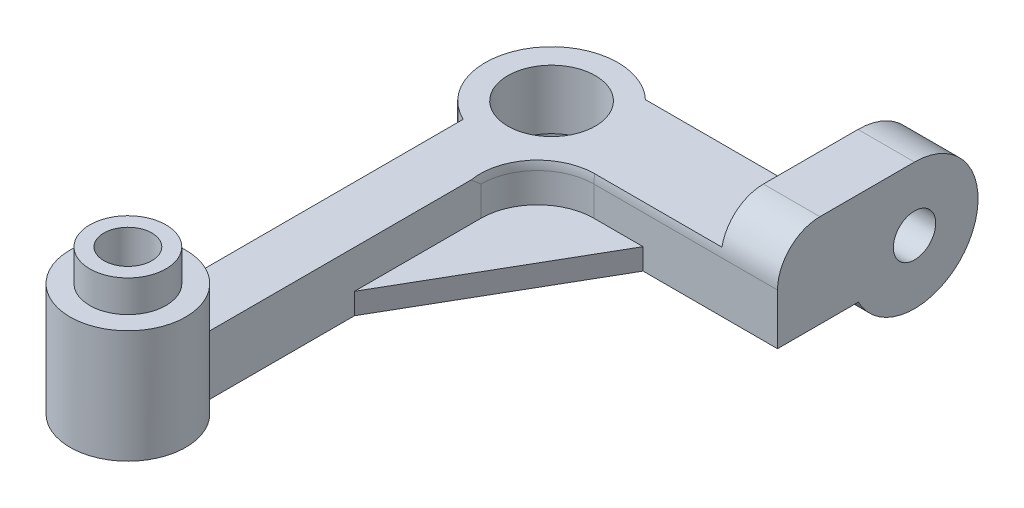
ISO-10303-21;
HEADER;
FILE_DESCRIPTION(('STEP AP214'),'2;1');
FILE_NAME('part.step','',(''),(''),'','','');
FILE_SCHEMA(('AUTOMOTIVE_DESIGN { 1 0 10303 214 1 1 1 1 }'));
ENDSEC;
DATA;
#1=APPLICATION_CONTEXT('core data for automotive mechanical design processes');
#2=APPLICATION_PROTOCOL_DEFINITION('international standard','automotive_design',2000,#1);
#3=PRODUCT_CONTEXT('',#1,'mechanical');
#4=PRODUCT('Part','Part','',(#3));
#5=PRODUCT_RELATED_PRODUCT_CATEGORY('part','',(#4));
#6=PRODUCT_DEFINITION_FORMATION('','',#4);
#7=PRODUCT_DEFINITION_CONTEXT('part definition',#1,'design');
#8=PRODUCT_DEFINITION('design','',#6,#7);
#9=PRODUCT_DEFINITION_SHAPE('','',#8);
#10=(LENGTH_UNIT() NAMED_UNIT(*) SI_UNIT(.MILLI.,.METRE.));
#11=(NAMED_UNIT(*) PLANE_ANGLE_UNIT() SI_UNIT($,.RADIAN.));
#12=(NAMED_UNIT(*) SI_UNIT($,.STERADIAN.) SOLID_ANGLE_UNIT());
#13=UNCERTAINTY_MEASURE_WITH_UNIT(LENGTH_MEASURE(1.E-05),#10,'distance_accuracy_value','');
#14=(GEOMETRIC_REPRESENTATION_CONTEXT(3) GLOBAL_UNCERTAINTY_ASSIGNED_CONTEXT((#13)) GLOBAL_UNIT_ASSIGNED_CONTEXT((#10,
#11,#12)) REPRESENTATION_CONTEXT('',''));
#15=CARTESIAN_POINT('',(0.,0.,0.));
#16=DIRECTION('',(0.,0.,1.));
#17=DIRECTION('',(1.,0.,0.));
#18=AXIS2_PLACEMENT_3D('',#15,#16,#17);
#19=CARTESIAN_POINT('',(0.,0.,30.));
#20=DIRECTION('',(0.,1.,0.));
#21=DIRECTION('',(0.,0.,1.));
#22=AXIS2_PLACEMENT_3D('',#19,#20,#21);
#23=PLANE('',#22);
#24=CARTESIAN_POINT('',(0.,0.,30.));
#25=DIRECTION('',(0.,1.,0.));
#26=DIRECTION('',(0.,0.,1.));
#27=AXIS2_PLACEMENT_3D('',#24,#25,#26);
#28=CIRCLE('',#27,1.7);
#29=CARTESIAN_POINT('',(0.,0.,31.7));
#30=VERTEX_POINT('',#29);
#31=EDGE_CURVE('E485',#30,#30,#28,.T.);
#32=ORIENTED_EDGE('',*,*,#31,.T.);
#33=EDGE_LOOP('',(#32));
#34=FACE_BOUND('',#33,.T.);
#35=DIRECTION('',(0.,0.,1.));
#36=VECTOR('',#35,1.);
#37=CARTESIAN_POINT('',(12.,0.,30.));
#38=LINE('',#37,#36);
#39=CARTESIAN_POINT('',(12.,0.,-3.4));
#40=VERTEX_POINT('',#39);
#41=CARTESIAN_POINT('',(12.,0.,-2.72005025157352));
#42=VERTEX_POINT('',#41);
#43=EDGE_CURVE('E199',#40,#42,#38,.T.);
#44=ORIENTED_EDGE('',*,*,#43,.T.);
#45=DIRECTION('',(-1.,0.,0.));
#46=VECTOR('',#45,1.);
#47=CARTESIAN_POINT('',(19.,0.,-2.72005025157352));
#48=LINE('',#47,#46);
#49=CARTESIAN_POINT('',(19.,0.,-2.72005025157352));
#50=VERTEX_POINT('',#49);
#51=EDGE_CURVE('E227',#50,#42,#48,.T.);
#52=ORIENTED_EDGE('',*,*,#51,.F.);
#53=DIRECTION('',(0.,0.,-1.));
#54=VECTOR('',#53,1.);
#55=CARTESIAN_POINT('',(19.,0.,3.00000000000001));
#56=LINE('',#55,#54);
#57=CARTESIAN_POINT('',(19.,0.,3.00000000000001));
#58=VERTEX_POINT('',#57);
#59=EDGE_CURVE('E225',#58,#50,#56,.T.);
#60=ORIENTED_EDGE('',*,*,#59,.F.);
#61=DIRECTION('',(1.,0.,0.));
#62=VECTOR('',#61,1.);
#63=CARTESIAN_POINT('',(15.,0.,3.));
#64=LINE('',#63,#62);
#65=CARTESIAN_POINT('',(9.47851149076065,0.,3.));
#66=VERTEX_POINT('',#65);
#67=EDGE_CURVE('E271',#66,#58,#64,.T.);
#68=ORIENTED_EDGE('',*,*,#67,.F.);
#69=DIRECTION('',(-0.500000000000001,0.,0.866025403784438));
#70=VECTOR('',#69,1.);
#71=CARTESIAN_POINT('',(2.,0.,15.9531618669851));
#72=LINE('',#71,#70);
#73=CARTESIAN_POINT('',(2.,0.,15.9531618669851));
#74=VERTEX_POINT('',#73);
#75=EDGE_CURVE('E242',#66,#74,#72,.T.);
#76=ORIENTED_EDGE('',*,*,#75,.T.);
#77=DIRECTION('',(0.,0.,-1.));
#78=VECTOR('',#77,1.);
#79=CARTESIAN_POINT('',(2.,0.,26.4208939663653));
#80=LINE('',#79,#78);
#81=CARTESIAN_POINT('',(2.,0.,26.4208939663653));
#82=VERTEX_POINT('',#81);
#83=EDGE_CURVE('E442',#82,#74,#80,.T.);
#84=ORIENTED_EDGE('',*,*,#83,.F.);
#85=CARTESIAN_POINT('',(0.,0.,30.));
#86=DIRECTION('',(0.,1.,0.));
#87=DIRECTION('',(0.,0.,1.));
#88=AXIS2_PLACEMENT_3D('',#85,#86,#87);
#89=CIRCLE('',#88,4.1);
#90=CARTESIAN_POINT('',(-2.,0.,26.4208939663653));
#91=VERTEX_POINT('',#90);
#92=EDGE_CURVE('E492',#91,#82,#89,.T.);
#93=ORIENTED_EDGE('',*,*,#92,.F.);
#94=DIRECTION('',(0.,0.,1.));
#95=VECTOR('',#94,1.);
#96=CARTESIAN_POINT('',(-2.,0.,26.4208939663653));
#97=LINE('',#96,#95);
#98=CARTESIAN_POINT('',(-1.99999999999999,0.,4.25323406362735));
#99=VERTEX_POINT('',#98);
#100=EDGE_CURVE('E259',#99,#91,#97,.T.);
#101=ORIENTED_EDGE('',*,*,#100,.F.);
#102=CARTESIAN_POINT('',(0.,0.,0.));
#103=DIRECTION('',(0.,-1.,0.));
#104=DIRECTION('',(0.,0.,-1.));
#105=AXIS2_PLACEMENT_3D('',#102,#103,#104);
#106=CIRCLE('',#105,4.7);
#107=CARTESIAN_POINT('',(3.24499614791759,0.,-3.4));
#108=VERTEX_POINT('',#107);
#109=EDGE_CURVE('E236',#108,#99,#106,.T.);
#110=ORIENTED_EDGE('',*,*,#109,.F.);
#111=DIRECTION('',(-1.,0.,0.));
#112=VECTOR('',#111,1.);
#113=CARTESIAN_POINT('',(3.24499614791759,0.,-3.4));
#114=LINE('',#113,#112);
#115=EDGE_CURVE('E262',#40,#108,#114,.T.);
#116=ORIENTED_EDGE('',*,*,#115,.F.);
#117=EDGE_LOOP('',(#44,#52,#60,#68,#76,#84,#93,#101,#110,#116));
#118=FACE_BOUND('',#117,.T.);
#119=ADVANCED_FACE('F35',(#34,#118),#23,.F.);
#120=CARTESIAN_POINT('',(3.24499614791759,4.2,-3.4));
#121=DIRECTION('',(0.,0.,1.));
#122=DIRECTION('',(1.,0.,0.));
#123=AXIS2_PLACEMENT_3D('',#120,#121,#122);
#124=PLANE('',#123);
#125=DIRECTION('',(0.,-1.,0.));
#126=VECTOR('',#125,1.);
#127=CARTESIAN_POINT('',(15.,4.2,-3.4));
#128=LINE('',#127,#126);
#129=CARTESIAN_POINT('',(15.,4.2,-3.4));
#130=VERTEX_POINT('',#129);
#131=CARTESIAN_POINT('',(15.,2.1,-3.4));
#132=VERTEX_POINT('',#131);
#133=EDGE_CURVE('E424',#130,#132,#128,.T.);
#134=ORIENTED_EDGE('',*,*,#133,.T.);
#135=DIRECTION('',(1.,0.,0.));
#136=VECTOR('',#135,1.);
#137=CARTESIAN_POINT('',(12.,2.1,-3.4));
#138=LINE('',#137,#136);
#139=CARTESIAN_POINT('',(12.,2.1,-3.4));
#140=VERTEX_POINT('',#139);
#141=EDGE_CURVE('E458',#140,#132,#138,.T.);
#142=ORIENTED_EDGE('',*,*,#141,.F.);
#143=DIRECTION('',(0.,-1.,0.));
#144=VECTOR('',#143,1.);
#145=CARTESIAN_POINT('',(12.,4.2,-3.4));
#146=LINE('',#145,#144);
#147=EDGE_CURVE('E189',#140,#40,#146,.T.);
#148=ORIENTED_EDGE('',*,*,#147,.T.);
#149=ORIENTED_EDGE('',*,*,#115,.T.);
#150=DIRECTION('',(0.,-1.,0.));
#151=VECTOR('',#150,1.);
#152=CARTESIAN_POINT('',(3.24499614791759,4.2,-3.4));
#153=LINE('',#152,#151);
#154=CARTESIAN_POINT('',(3.24499614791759,4.2,-3.4));
#155=VERTEX_POINT('',#154);
#156=EDGE_CURVE('E255',#155,#108,#153,.T.);
#157=ORIENTED_EDGE('',*,*,#156,.F.);
#158=DIRECTION('',(-1.,0.,0.));
#159=VECTOR('',#158,1.);
#160=CARTESIAN_POINT('',(3.24499614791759,4.2,-3.4));
#161=LINE('',#160,#159);
#162=EDGE_CURVE('E385',#130,#155,#161,.T.);
#163=ORIENTED_EDGE('',*,*,#162,.F.);
#164=EDGE_LOOP('',(#134,#142,#148,#149,#157,#163));
#165=FACE_BOUND('',#164,.T.);
#166=ADVANCED_FACE('F343',(#165),#124,.F.);
#167=CARTESIAN_POINT('',(15.,2.1,-6.69999999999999));
#168=DIRECTION('',(1.,0.,0.));
#169=DIRECTION('',(0.,0.,-1.));
#170=AXIS2_PLACEMENT_3D('',#167,#168,#169);
#171=PLANE('',#170);
#172=DIRECTION('',(0.,0.,-1.));
#173=VECTOR('',#172,1.);
#174=CARTESIAN_POINT('',(15.,4.2,-3.4));
#175=LINE('',#174,#173);
#176=CARTESIAN_POINT('',(15.,4.2,2.93938769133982));
#177=VERTEX_POINT('',#176);
#178=EDGE_CURVE('E382',#177,#130,#175,.T.);
#179=ORIENTED_EDGE('',*,*,#178,.F.);
#180=CARTESIAN_POINT('',(15.,3.6,0.));
#181=DIRECTION('',(1.,0.,0.));
#182=DIRECTION('',(0.,0.,-1.));
#183=AXIS2_PLACEMENT_3D('',#180,#181,#182);
#184=CIRCLE('',#183,3.);
#185=CARTESIAN_POINT('',(15.,6.6,0.));
#186=VERTEX_POINT('',#185);
#187=EDGE_CURVE('E375',#177,#186,#184,.F.);
#188=ORIENTED_EDGE('',*,*,#187,.T.);
#189=DIRECTION('',(0.,0.,1.));
#190=VECTOR('',#189,1.);
#191=CARTESIAN_POINT('',(15.,6.6,-6.7));
#192=LINE('',#191,#190);
#193=CARTESIAN_POINT('',(15.,6.6,-6.7));
#194=VERTEX_POINT('',#193);
#195=EDGE_CURVE('E221',#194,#186,#192,.T.);
#196=ORIENTED_EDGE('',*,*,#195,.F.);
#197=CARTESIAN_POINT('',(15.,2.1,-6.69999999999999));
#198=DIRECTION('',(1.,0.,0.));
#199=DIRECTION('',(0.,0.,-1.));
#200=AXIS2_PLACEMENT_3D('',#197,#198,#199);
#201=CIRCLE('',#200,4.5);
#202=CARTESIAN_POINT('',(15.,4.31149343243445,-10.6190938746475));
#203=VERTEX_POINT('',#202);
#204=EDGE_CURVE('E216',#203,#194,#201,.T.);
#205=ORIENTED_EDGE('',*,*,#204,.F.);
#206=DIRECTION('',(0.,0.,-1.));
#207=VECTOR('',#206,1.);
#208=CARTESIAN_POINT('',(15.,4.31149343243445,-9.99999999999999));
#209=LINE('',#208,#207);
#210=CARTESIAN_POINT('',(15.,4.31149343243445,-9.99999999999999));
#211=VERTEX_POINT('',#210);
#212=EDGE_CURVE('E193',#211,#203,#209,.T.);
#213=ORIENTED_EDGE('',*,*,#212,.F.);
#214=DIRECTION('',(0.,1.,0.));
#215=VECTOR('',#214,1.);
#216=CARTESIAN_POINT('',(15.,2.1,-9.99999999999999));
#217=LINE('',#216,#215);
#218=CARTESIAN_POINT('',(15.,2.1,-9.99999999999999));
#219=VERTEX_POINT('',#218);
#220=EDGE_CURVE('E451',#219,#211,#217,.T.);
#221=ORIENTED_EDGE('',*,*,#220,.F.);
#222=CARTESIAN_POINT('',(15.,2.1,-6.69999999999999));
#223=DIRECTION('',(-1.,0.,0.));
#224=DIRECTION('',(0.,0.,1.));
#225=AXIS2_PLACEMENT_3D('',#222,#223,#224);
#226=CIRCLE('',#225,3.3);
#227=EDGE_CURVE('E198',#132,#219,#226,.T.);
#228=ORIENTED_EDGE('',*,*,#227,.F.);
#229=ORIENTED_EDGE('',*,*,#133,.F.);
#230=EDGE_LOOP('',(#179,#188,#196,#205,#213,#221,#228,#229));
#231=FACE_BOUND('',#230,.T.);
#232=ADVANCED_FACE('F356',(#231),#171,.F.);
#233=CARTESIAN_POINT('',(19.,2.1,-6.69999999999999));
#234=DIRECTION('',(-1.,0.,0.));
#235=DIRECTION('',(0.,0.,1.));
#236=AXIS2_PLACEMENT_3D('',#233,#234,#235);
#237=CYLINDRICAL_SURFACE('',#236,1.5);
#238=CARTESIAN_POINT('',(19.,2.1,-6.69999999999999));
#239=DIRECTION('',(1.,0.,0.));
#240=DIRECTION('',(0.,0.,-1.));
#241=AXIS2_PLACEMENT_3D('',#238,#239,#240);
#242=CIRCLE('',#241,1.5);
#243=CARTESIAN_POINT('',(19.,2.1,-8.2));
#244=VERTEX_POINT('',#243);
#245=EDGE_CURVE('E213',#244,#244,#242,.T.);
#246=ORIENTED_EDGE('',*,*,#245,.T.);
#247=EDGE_LOOP('',(#246));
#248=FACE_BOUND('',#247,.T.);
#249=CARTESIAN_POINT('',(16.,2.1,-6.69999999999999));
#250=DIRECTION('',(-1.,0.,0.));
#251=DIRECTION('',(0.,0.,1.));
#252=AXIS2_PLACEMENT_3D('',#249,#250,#251);
#253=CIRCLE('',#252,1.5);
#254=CARTESIAN_POINT('',(16.,2.1,-5.2));
#255=VERTEX_POINT('',#254);
#256=EDGE_CURVE('E211',#255,#255,#253,.T.);
#257=ORIENTED_EDGE('',*,*,#256,.T.);
#258=EDGE_LOOP('',(#257));
#259=FACE_BOUND('',#258,.T.);
#260=ADVANCED_FACE('F396',(#248,#259),#237,.F.);
#261=CARTESIAN_POINT('',(0.,0.,0.));
#262=DIRECTION('',(0.,1.,0.));
#263=DIRECTION('',(0.,0.,1.));
#264=AXIS2_PLACEMENT_3D('',#261,#262,#263);
#265=CIRCLE('',#264,3.1);
#266=CARTESIAN_POINT('',(0.,0.,3.1));
#267=VERTEX_POINT('',#266);
#268=EDGE_CURVE('E488',#267,#267,#265,.T.);
#269=ORIENTED_EDGE('',*,*,#268,.T.);
#270=EDGE_LOOP('',(#269));
#271=FACE_BOUND('',#270,.T.);
#272=CARTESIAN_POINT('',(0.,0.,0.));
#273=DIRECTION('',(0.,-1.,0.));
#274=DIRECTION('',(0.,0.,-1.));
#275=AXIS2_PLACEMENT_3D('',#272,#273,#274);
#276=CIRCLE('',#275,3.2);
#277=CARTESIAN_POINT('',(0.,0.,-3.2));
#278=VERTEX_POINT('',#277);
#279=EDGE_CURVE('E232',#278,#278,#276,.T.);
#280=ORIENTED_EDGE('',*,*,#279,.T.);
#281=EDGE_LOOP('',(#280));
#282=FACE_BOUND('',#281,.T.);
#283=ADVANCED_FACE('F345',(#271,#282),#23,.F.);
#284=CARTESIAN_POINT('',(6.00000000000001,4.2,7.00000000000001));
#285=DIRECTION('',(0.,-1.,0.));
#286=DIRECTION('',(0.,0.,-1.));
#287=AXIS2_PLACEMENT_3D('',#284,#285,#286);
#288=CYLINDRICAL_SURFACE('',#287,4.);
#289=DIRECTION('',(0.,-1.,0.));
#290=VECTOR('',#289,1.);
#291=CARTESIAN_POINT('',(6.00000000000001,4.2,3.00000000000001));
#292=LINE('',#291,#290);
#293=CARTESIAN_POINT('',(6.00000000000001,3.6,3.00000000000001));
#294=VERTEX_POINT('',#293);
#295=CARTESIAN_POINT('',(6.00000000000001,1.5,3.00000000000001));
#296=VERTEX_POINT('',#295);
#297=EDGE_CURVE('E465',#294,#296,#292,.T.);
#298=ORIENTED_EDGE('',*,*,#297,.F.);
#299=CARTESIAN_POINT('',(6.00000000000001,3.6,7.00000000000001));
#300=DIRECTION('',(0.,-1.,0.));
#301=DIRECTION('',(0.,0.,-1.));
#302=AXIS2_PLACEMENT_3D('',#299,#300,#301);
#303=CIRCLE('',#302,4.);
#304=CARTESIAN_POINT('',(2.00000000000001,3.6,7.00000000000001));
#305=VERTEX_POINT('',#304);
#306=EDGE_CURVE('E59',#294,#305,#303,.F.);
#307=ORIENTED_EDGE('',*,*,#306,.T.);
#308=DIRECTION('',(0.,-1.,0.));
#309=VECTOR('',#308,1.);
#310=CARTESIAN_POINT('',(2.00000000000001,4.2,7.00000000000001));
#311=LINE('',#310,#309);
#312=CARTESIAN_POINT('',(2.00000000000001,1.5,7.00000000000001));
#313=VERTEX_POINT('',#312);
#314=EDGE_CURVE('E467',#305,#313,#311,.T.);
#315=ORIENTED_EDGE('',*,*,#314,.T.);
#316=CARTESIAN_POINT('',(6.00000000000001,1.5,7.00000000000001));
#317=DIRECTION('',(0.,-1.,0.));
#318=DIRECTION('',(0.,0.,-1.));
#319=AXIS2_PLACEMENT_3D('',#316,#317,#318);
#320=CIRCLE('',#319,4.);
#321=EDGE_CURVE('E510',#296,#313,#320,.F.);
#322=ORIENTED_EDGE('',*,*,#321,.F.);
#323=EDGE_LOOP('',(#298,#307,#315,#322));
#324=FACE_BOUND('',#323,.T.);
#325=ADVANCED_FACE('F327',(#324),#288,.F.);
#326=CARTESIAN_POINT('',(0.,8.,30.));
#327=DIRECTION('',(0.,1.,0.));
#328=DIRECTION('',(0.,0.,1.));
#329=AXIS2_PLACEMENT_3D('',#326,#327,#328);
#330=PLANE('',#329);
#331=CARTESIAN_POINT('',(0.,8.,30.));
#332=DIRECTION('',(0.,1.,0.));
#333=DIRECTION('',(0.,0.,1.));
#334=AXIS2_PLACEMENT_3D('',#331,#332,#333);
#335=CIRCLE('',#334,4.1);
#336=CARTESIAN_POINT('',(0.,8.,34.1));
#337=VERTEX_POINT('',#336);
#338=EDGE_CURVE('E482',#337,#337,#335,.T.);
#339=ORIENTED_EDGE('',*,*,#338,.T.);
#340=EDGE_LOOP('',(#339));
#341=FACE_BOUND('',#340,.T.);
#342=CARTESIAN_POINT('',(0.,8.,30.));
#343=DIRECTION('',(0.,1.,0.));
#344=DIRECTION('',(0.,0.,1.));
#345=AXIS2_PLACEMENT_3D('',#342,#343,#344);
#346=CIRCLE('',#345,2.7);
#347=CARTESIAN_POINT('',(0.,8.,32.7));
#348=VERTEX_POINT('',#347);
#349=EDGE_CURVE('E520',#348,#348,#346,.T.);
#350=ORIENTED_EDGE('',*,*,#349,.F.);
#351=EDGE_LOOP('',(#350));
#352=FACE_BOUND('',#351,.T.);
#353=ADVANCED_FACE('F323',(#341,#352),#330,.T.);
#354=CARTESIAN_POINT('',(0.,4.2,30.));
#355=DIRECTION('',(0.,1.,0.));
#356=DIRECTION('',(0.,0.,1.));
#357=AXIS2_PLACEMENT_3D('',#354,#355,#356);
#358=PLANE('',#357);
#359=CARTESIAN_POINT('',(6.00000000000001,4.2,7.00000000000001));
#360=DIRECTION('',(0.,-1.,0.));
#361=DIRECTION('',(0.,0.,-1.));
#362=AXIS2_PLACEMENT_3D('',#359,#360,#361);
#363=CIRCLE('',#362,4.06061230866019);
#364=CARTESIAN_POINT('',(2.,4.2,7.69897948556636));
#365=VERTEX_POINT('',#364);
#366=CARTESIAN_POINT('',(6.00000000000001,4.2,2.93938769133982));
#367=VERTEX_POINT('',#366);
#368=EDGE_CURVE('E379',#365,#367,#363,.T.);
#369=ORIENTED_EDGE('',*,*,#368,.T.);
#370=DIRECTION('',(-1.,0.,0.));
#371=VECTOR('',#370,1.);
#372=CARTESIAN_POINT('',(6.00000000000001,4.2,2.93938769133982));
#373=LINE('',#372,#371);
#374=EDGE_CURVE('E377',#367,#177,#373,.F.);
#375=ORIENTED_EDGE('',*,*,#374,.T.);
#376=ORIENTED_EDGE('',*,*,#178,.T.);
#377=ORIENTED_EDGE('',*,*,#162,.T.);
#378=CARTESIAN_POINT('',(0.,4.2,0.));
#379=DIRECTION('',(0.,1.,0.));
#380=DIRECTION('',(0.,0.,1.));
#381=AXIS2_PLACEMENT_3D('',#378,#379,#380);
#382=CIRCLE('',#381,4.7);
#383=CARTESIAN_POINT('',(-1.99999999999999,4.2,4.25323406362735));
#384=VERTEX_POINT('',#383);
#385=EDGE_CURVE('E496',#155,#384,#382,.T.);
#386=ORIENTED_EDGE('',*,*,#385,.T.);
#387=DIRECTION('',(0.,0.,1.));
#388=VECTOR('',#387,1.);
#389=CARTESIAN_POINT('',(-2.,4.2,26.4208939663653));
#390=LINE('',#389,#388);
#391=CARTESIAN_POINT('',(-2.,4.2,26.4208939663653));
#392=VERTEX_POINT('',#391);
#393=EDGE_CURVE('E498',#384,#392,#390,.T.);
#394=ORIENTED_EDGE('',*,*,#393,.T.);
#395=CARTESIAN_POINT('',(0.,4.2,30.));
#396=DIRECTION('',(0.,1.,0.));
#397=DIRECTION('',(0.,0.,1.));
#398=AXIS2_PLACEMENT_3D('',#395,#396,#397);
#399=CIRCLE('',#398,4.1);
#400=CARTESIAN_POINT('',(2.,4.2,26.4208939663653));
#401=VERTEX_POINT('',#400);
#402=EDGE_CURVE('E478',#401,#392,#399,.T.);
#403=ORIENTED_EDGE('',*,*,#402,.F.);
#404=DIRECTION('',(0.,0.,-1.));
#405=VECTOR('',#404,1.);
#406=CARTESIAN_POINT('',(2.,4.2,26.4208939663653));
#407=LINE('',#406,#405);
#408=EDGE_CURVE('E261',#401,#365,#407,.T.);
#409=ORIENTED_EDGE('',*,*,#408,.T.);
#410=EDGE_LOOP('',(#369,#375,#376,#377,#386,#394,#403,#409));
#411=FACE_BOUND('',#410,.T.);
#412=CARTESIAN_POINT('',(0.,4.2,0.));
#413=DIRECTION('',(0.,1.,0.));
#414=DIRECTION('',(0.,0.,1.));
#415=AXIS2_PLACEMENT_3D('',#412,#413,#414);
#416=CIRCLE('',#415,3.1);
#417=CARTESIAN_POINT('',(0.,4.2,3.1));
#418=VERTEX_POINT('',#417);
#419=EDGE_CURVE('E489',#418,#418,#416,.T.);
#420=ORIENTED_EDGE('',*,*,#419,.F.);
#421=EDGE_LOOP('',(#420));
#422=FACE_BOUND('',#421,.T.);
#423=ADVANCED_FACE('F326',(#411,#422),#358,.T.);
#424=CARTESIAN_POINT('',(0.,4.2,30.));
#425=DIRECTION('',(0.,-1.,0.));
#426=DIRECTION('',(0.,0.,-1.));
#427=AXIS2_PLACEMENT_3D('',#424,#425,#426);
#428=CYLINDRICAL_SURFACE('',#427,4.1);
#429=ORIENTED_EDGE('',*,*,#92,.T.);
#430=DIRECTION('',(0.,-1.,0.));
#431=VECTOR('',#430,1.);
#432=CARTESIAN_POINT('',(2.,4.2,26.4208939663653));
#433=LINE('',#432,#431);
#434=EDGE_CURVE('E473',#401,#82,#433,.T.);
#435=ORIENTED_EDGE('',*,*,#434,.F.);
#436=ORIENTED_EDGE('',*,*,#402,.T.);
#437=DIRECTION('',(0.,-1.,0.));
#438=VECTOR('',#437,1.);
#439=CARTESIAN_POINT('',(-2.,4.2,26.4208939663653));
#440=LINE('',#439,#438);
#441=EDGE_CURVE('E256',#392,#91,#440,.T.);
#442=ORIENTED_EDGE('',*,*,#441,.T.);
#443=EDGE_LOOP('',(#429,#435,#436,#442));
#444=FACE_BOUND('',#443,.T.);
#445=ORIENTED_EDGE('',*,*,#338,.F.);
#446=EDGE_LOOP('',(#445));
#447=FACE_BOUND('',#446,.T.);
#448=ADVANCED_FACE('F339',(#444,#447),#428,.T.);
#449=CARTESIAN_POINT('',(2.,4.2,26.4208939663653));
#450=DIRECTION('',(-1.,0.,0.));
#451=DIRECTION('',(0.,0.,1.));
#452=AXIS2_PLACEMENT_3D('',#449,#450,#451);
#453=PLANE('',#452);
#454=ORIENTED_EDGE('',*,*,#314,.F.);
#455=CARTESIAN_POINT('',(2.,4.2,7.69897948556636));
#456=CARTESIAN_POINT('',(2.00000000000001,4.10237899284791,7.58321865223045));
#457=CARTESIAN_POINT('',(2.00000000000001,4.00401303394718,7.46809592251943));
#458=CARTESIAN_POINT('',(2.00000000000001,3.80652812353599,7.23849961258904));
#459=CARTESIAN_POINT('',(2.00000000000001,3.70740918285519,7.12402602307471));
#460=CARTESIAN_POINT('',(2.00000000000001,3.60552052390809,7.00637455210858));
#461=CARTESIAN_POINT('',(2.00000000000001,3.60276026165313,7.00318727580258));
#462=CARTESIAN_POINT('',(2.00000000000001,3.6,7.));
#463=B_SPLINE_CURVE_WITH_KNOTS('',3,(#455,#456,#457,#458,#459,#460,#461,#462),.UNSPECIFIED.,.F.,
.F.,(4,2,2,4),(0.,0.454271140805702,0.908535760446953,0.921184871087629),.UNSPECIFIED.);
#464=EDGE_CURVE('E368',#305,#365,#463,.F.);
#465=ORIENTED_EDGE('',*,*,#464,.T.);
#466=ORIENTED_EDGE('',*,*,#408,.F.);
#467=ORIENTED_EDGE('',*,*,#434,.T.);
#468=ORIENTED_EDGE('',*,*,#83,.T.);
#469=DIRECTION('',(0.,-1.,0.));
#470=VECTOR('',#469,1.);
#471=CARTESIAN_POINT('',(2.,1.5,15.9531618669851));
#472=LINE('',#471,#470);
#473=CARTESIAN_POINT('',(2.,1.5,15.9531618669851));
#474=VERTEX_POINT('',#473);
#475=EDGE_CURVE('E503',#474,#74,#472,.T.);
#476=ORIENTED_EDGE('',*,*,#475,.F.);
#477=DIRECTION('',(0.,0.,-1.));
#478=VECTOR('',#477,1.);
#479=CARTESIAN_POINT('',(2.,1.5,3.));
#480=LINE('',#479,#478);
#481=EDGE_CURVE('E245',#474,#313,#480,.T.);
#482=ORIENTED_EDGE('',*,*,#481,.T.);
#483=EDGE_LOOP('',(#454,#465,#466,#467,#468,#476,#482));
#484=FACE_BOUND('',#483,.T.);
#485=ADVANCED_FACE('F360',(#484),#453,.F.);
#486=CARTESIAN_POINT('',(15.,4.2,3.));
#487=DIRECTION('',(0.,0.,-1.));
#488=DIRECTION('',(-1.,0.,0.));
#489=AXIS2_PLACEMENT_3D('',#486,#487,#488);
#490=PLANE('',#489);
#491=DIRECTION('',(0.,-1.,0.));
#492=VECTOR('',#491,1.);
#493=CARTESIAN_POINT('',(19.,0.,3.00000000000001));
#494=LINE('',#493,#492);
#495=CARTESIAN_POINT('',(19.,3.6,3.00000000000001));
#496=VERTEX_POINT('',#495);
#497=EDGE_CURVE('E223',#496,#58,#494,.T.);
#498=ORIENTED_EDGE('',*,*,#497,.F.);
#499=DIRECTION('',(-1.,0.,0.));
#500=VECTOR('',#499,1.);
#501=CARTESIAN_POINT('',(15.,3.6,3.));
#502=LINE('',#501,#500);
#503=EDGE_CURVE('E381',#496,#294,#502,.T.);
#504=ORIENTED_EDGE('',*,*,#503,.T.);
#505=ORIENTED_EDGE('',*,*,#297,.T.);
#506=DIRECTION('',(-1.,0.,0.));
#507=VECTOR('',#506,1.);
#508=CARTESIAN_POINT('',(15.,1.5,3.));
#509=LINE('',#508,#507);
#510=CARTESIAN_POINT('',(9.47851149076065,1.5,3.));
#511=VERTEX_POINT('',#510);
#512=EDGE_CURVE('E250',#511,#296,#509,.T.);
#513=ORIENTED_EDGE('',*,*,#512,.F.);
#514=DIRECTION('',(0.,-1.,0.));
#515=VECTOR('',#514,1.);
#516=CARTESIAN_POINT('',(9.47851149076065,1.5,3.));
#517=LINE('',#516,#515);
#518=EDGE_CURVE('E438',#511,#66,#517,.T.);
#519=ORIENTED_EDGE('',*,*,#518,.T.);
#520=ORIENTED_EDGE('',*,*,#67,.T.);
#521=EDGE_LOOP('',(#498,#504,#505,#513,#519,#520));
#522=FACE_BOUND('',#521,.T.);
#523=ADVANCED_FACE('F352',(#522),#490,.F.);
#524=CARTESIAN_POINT('',(0.,4.2,0.));
#525=DIRECTION('',(0.,-1.,0.));
#526=DIRECTION('',(0.,0.,-1.));
#527=AXIS2_PLACEMENT_3D('',#524,#525,#526);
#528=CYLINDRICAL_SURFACE('',#527,4.7);
#529=ORIENTED_EDGE('',*,*,#156,.T.);
#530=ORIENTED_EDGE('',*,*,#109,.T.);
#531=DIRECTION('',(0.,-1.,0.));
#532=VECTOR('',#531,1.);
#533=CARTESIAN_POINT('',(-1.99999999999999,4.2,4.25323406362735));
#534=LINE('',#533,#532);
#535=EDGE_CURVE('E252',#384,#99,#534,.T.);
#536=ORIENTED_EDGE('',*,*,#535,.F.);
#537=ORIENTED_EDGE('',*,*,#385,.F.);
#538=EDGE_LOOP('',(#529,#530,#536,#537));
#539=FACE_BOUND('',#538,.T.);
#540=CARTESIAN_POINT('',(0.,-3.,0.));
#541=DIRECTION('',(0.,-1.,0.));
#542=DIRECTION('',(0.,0.,-1.));
#543=AXIS2_PLACEMENT_3D('',#540,#541,#542);
#544=CIRCLE('',#543,4.7);
#545=CARTESIAN_POINT('',(0.,-3.,-4.7));
#546=VERTEX_POINT('',#545);
#547=EDGE_CURVE('E239',#546,#546,#544,.T.);
#548=ORIENTED_EDGE('',*,*,#547,.F.);
#549=EDGE_LOOP('',(#548));
#550=FACE_BOUND('',#549,.T.);
#551=ADVANCED_FACE('F348',(#539,#550),#528,.T.);
#552=CARTESIAN_POINT('',(-2.,4.2,26.4208939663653));
#553=DIRECTION('',(1.,0.,0.));
#554=DIRECTION('',(0.,0.,-1.));
#555=AXIS2_PLACEMENT_3D('',#552,#553,#554);
#556=PLANE('',#555);
#557=ORIENTED_EDGE('',*,*,#100,.T.);
#558=ORIENTED_EDGE('',*,*,#441,.F.);
#559=ORIENTED_EDGE('',*,*,#393,.F.);
#560=ORIENTED_EDGE('',*,*,#535,.T.);
#561=EDGE_LOOP('',(#557,#558,#559,#560));
#562=FACE_BOUND('',#561,.T.);
#563=ADVANCED_FACE('F335',(#562),#556,.F.);
#564=CARTESIAN_POINT('',(0.,4.2,0.));
#565=DIRECTION('',(0.,-1.,0.));
#566=DIRECTION('',(0.,0.,-1.));
#567=AXIS2_PLACEMENT_3D('',#564,#565,#566);
#568=CYLINDRICAL_SURFACE('',#567,3.1);
#569=ORIENTED_EDGE('',*,*,#419,.T.);
#570=EDGE_LOOP('',(#569));
#571=FACE_BOUND('',#570,.T.);
#572=ORIENTED_EDGE('',*,*,#268,.F.);
#573=EDGE_LOOP('',(#572));
#574=FACE_BOUND('',#573,.T.);
#575=ADVANCED_FACE('F331',(#571,#574),#568,.F.);
#576=CARTESIAN_POINT('',(0.,4.2,30.));
#577=DIRECTION('',(0.,-1.,0.));
#578=DIRECTION('',(0.,0.,-1.));
#579=AXIS2_PLACEMENT_3D('',#576,#577,#578);
#580=CYLINDRICAL_SURFACE('',#579,1.7);
#581=ORIENTED_EDGE('',*,*,#31,.F.);
#582=EDGE_LOOP('',(#581));
#583=FACE_BOUND('',#582,.T.);
#584=CARTESIAN_POINT('',(0.,10.25,30.));
#585=DIRECTION('',(0.,1.,0.));
#586=DIRECTION('',(0.,0.,1.));
#587=AXIS2_PLACEMENT_3D('',#584,#585,#586);
#588=CIRCLE('',#587,1.7);
#589=CARTESIAN_POINT('',(0.,10.25,31.7));
#590=VERTEX_POINT('',#589);
#591=EDGE_CURVE('E517',#590,#590,#588,.T.);
#592=ORIENTED_EDGE('',*,*,#591,.T.);
#593=EDGE_LOOP('',(#592));
#594=FACE_BOUND('',#593,.T.);
#595=ADVANCED_FACE('F318',(#583,#594),#580,.F.);
#596=CARTESIAN_POINT('',(0.,10.25,30.));
#597=DIRECTION('',(0.,1.,0.));
#598=DIRECTION('',(0.,0.,1.));
#599=AXIS2_PLACEMENT_3D('',#596,#597,#598);
#600=PLANE('',#599);
#601=CARTESIAN_POINT('',(0.,10.25,30.));
#602=DIRECTION('',(0.,1.,0.));
#603=DIRECTION('',(0.,0.,1.));
#604=AXIS2_PLACEMENT_3D('',#601,#602,#603);
#605=CIRCLE('',#604,2.7);
#606=CARTESIAN_POINT('',(0.,10.25,32.7));
#607=VERTEX_POINT('',#606);
#608=EDGE_CURVE('E483',#607,#607,#605,.T.);
#609=ORIENTED_EDGE('',*,*,#608,.T.);
#610=EDGE_LOOP('',(#609));
#611=FACE_BOUND('',#610,.T.);
#612=ORIENTED_EDGE('',*,*,#591,.F.);
#613=EDGE_LOOP('',(#612));
#614=FACE_BOUND('',#613,.T.);
#615=ADVANCED_FACE('F315',(#611,#614),#600,.T.);
#616=CARTESIAN_POINT('',(0.,10.25,30.));
#617=DIRECTION('',(0.,-1.,0.));
#618=DIRECTION('',(0.,0.,-1.));
#619=AXIS2_PLACEMENT_3D('',#616,#617,#618);
#620=CYLINDRICAL_SURFACE('',#619,2.7);
#621=ORIENTED_EDGE('',*,*,#608,.F.);
#622=EDGE_LOOP('',(#621));
#623=FACE_BOUND('',#622,.T.);
#624=ORIENTED_EDGE('',*,*,#349,.T.);
#625=EDGE_LOOP('',(#624));
#626=FACE_BOUND('',#625,.T.);
#627=ADVANCED_FACE('F310',(#623,#626),#620,.T.);
#628=CARTESIAN_POINT('',(0.,1.5,0.));
#629=DIRECTION('',(0.,-1.,0.));
#630=DIRECTION('',(0.,0.,-1.));
#631=AXIS2_PLACEMENT_3D('',#628,#629,#630);
#632=PLANE('',#631);
#633=ORIENTED_EDGE('',*,*,#512,.T.);
#634=ORIENTED_EDGE('',*,*,#321,.T.);
#635=ORIENTED_EDGE('',*,*,#481,.F.);
#636=DIRECTION('',(-0.500000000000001,0.,0.866025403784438));
#637=VECTOR('',#636,1.);
#638=CARTESIAN_POINT('',(2.,1.5,15.9531618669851));
#639=LINE('',#638,#637);
#640=EDGE_CURVE('E509',#511,#474,#639,.T.);
#641=ORIENTED_EDGE('',*,*,#640,.F.);
#642=EDGE_LOOP('',(#633,#634,#635,#641));
#643=FACE_BOUND('',#642,.T.);
#644=ADVANCED_FACE('F307',(#643),#632,.F.);
#645=CARTESIAN_POINT('',(2.,1.5,15.9531618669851));
#646=DIRECTION('',(0.866025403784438,0.,0.500000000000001));
#647=DIRECTION('',(0.500000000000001,0.,-0.866025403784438));
#648=AXIS2_PLACEMENT_3D('',#645,#646,#647);
#649=PLANE('',#648);
#650=ORIENTED_EDGE('',*,*,#75,.F.);
#651=ORIENTED_EDGE('',*,*,#518,.F.);
#652=ORIENTED_EDGE('',*,*,#640,.T.);
#653=ORIENTED_EDGE('',*,*,#475,.T.);
#654=EDGE_LOOP('',(#650,#651,#652,#653));
#655=FACE_BOUND('',#654,.T.);
#656=ADVANCED_FACE('F305',(#655),#649,.T.);
#657=CARTESIAN_POINT('',(0.,-3.,0.));
#658=DIRECTION('',(0.,-1.,0.));
#659=DIRECTION('',(0.,0.,-1.));
#660=AXIS2_PLACEMENT_3D('',#657,#658,#659);
#661=PLANE('',#660);
#662=ORIENTED_EDGE('',*,*,#547,.T.);
#663=EDGE_LOOP('',(#662));
#664=FACE_BOUND('',#663,.T.);
#665=CARTESIAN_POINT('',(0.,-3.,0.));
#666=DIRECTION('',(0.,-1.,0.));
#667=DIRECTION('',(0.,0.,-1.));
#668=AXIS2_PLACEMENT_3D('',#665,#666,#667);
#669=CIRCLE('',#668,3.2);
#670=CARTESIAN_POINT('',(0.,-3.,-3.2));
#671=VERTEX_POINT('',#670);
#672=EDGE_CURVE('E233',#671,#671,#669,.T.);
#673=ORIENTED_EDGE('',*,*,#672,.F.);
#674=EDGE_LOOP('',(#673));
#675=FACE_BOUND('',#674,.T.);
#676=ADVANCED_FACE('F301',(#664,#675),#661,.T.);
#677=CARTESIAN_POINT('',(0.,-3.,0.));
#678=DIRECTION('',(0.,1.,0.));
#679=DIRECTION('',(0.,0.,1.));
#680=AXIS2_PLACEMENT_3D('',#677,#678,#679);
#681=CYLINDRICAL_SURFACE('',#680,3.2);
#682=ORIENTED_EDGE('',*,*,#672,.T.);
#683=EDGE_LOOP('',(#682));
#684=FACE_BOUND('',#683,.T.);
#685=ORIENTED_EDGE('',*,*,#279,.F.);
#686=EDGE_LOOP('',(#685));
#687=FACE_BOUND('',#686,.T.);
#688=ADVANCED_FACE('F298',(#684,#687),#681,.F.);
#689=CARTESIAN_POINT('',(19.,2.1,-6.69999999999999));
#690=DIRECTION('',(1.,0.,0.));
#691=DIRECTION('',(0.,0.,-1.));
#692=AXIS2_PLACEMENT_3D('',#689,#690,#691);
#693=PLANE('',#692);
#694=DIRECTION('',(0.,0.,1.));
#695=VECTOR('',#694,1.);
#696=CARTESIAN_POINT('',(19.,6.6,-6.7));
#697=LINE('',#696,#695);
#698=CARTESIAN_POINT('',(19.,6.6,-6.7));
#699=VERTEX_POINT('',#698);
#700=CARTESIAN_POINT('',(19.,6.6,0.));
#701=VERTEX_POINT('',#700);
#702=EDGE_CURVE('E220',#699,#701,#697,.T.);
#703=ORIENTED_EDGE('',*,*,#702,.T.);
#704=CARTESIAN_POINT('',(19.,3.6,0.));
#705=DIRECTION('',(1.,0.,0.));
#706=DIRECTION('',(0.,0.,-1.));
#707=AXIS2_PLACEMENT_3D('',#704,#705,#706);
#708=CIRCLE('',#707,3.);
#709=EDGE_CURVE('E11',#701,#496,#708,.T.);
#710=ORIENTED_EDGE('',*,*,#709,.T.);
#711=ORIENTED_EDGE('',*,*,#497,.T.);
#712=ORIENTED_EDGE('',*,*,#59,.T.);
#713=CARTESIAN_POINT('',(19.,2.1,-6.69999999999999));
#714=DIRECTION('',(1.,0.,0.));
#715=DIRECTION('',(0.,0.,-1.));
#716=AXIS2_PLACEMENT_3D('',#713,#714,#715);
#717=CIRCLE('',#716,4.5);
#718=EDGE_CURVE('E217',#50,#699,#717,.T.);
#719=ORIENTED_EDGE('',*,*,#718,.T.);
#720=EDGE_LOOP('',(#703,#710,#711,#712,#719));
#721=FACE_BOUND('',#720,.T.);
#722=ORIENTED_EDGE('',*,*,#245,.F.);
#723=EDGE_LOOP('',(#722));
#724=FACE_BOUND('',#723,.T.);
#725=ADVANCED_FACE('F295',(#721,#724),#693,.T.);
#726=CARTESIAN_POINT('',(19.,2.1,-6.69999999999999));
#727=DIRECTION('',(-1.,0.,0.));
#728=DIRECTION('',(0.,0.,1.));
#729=AXIS2_PLACEMENT_3D('',#726,#727,#728);
#730=CYLINDRICAL_SURFACE('',#729,4.5);
#731=CARTESIAN_POINT('',(12.,2.1,-6.7));
#732=DIRECTION('',(-1.,0.,0.));
#733=DIRECTION('',(0.,0.,1.));
#734=AXIS2_PLACEMENT_3D('',#731,#732,#733);
#735=CIRCLE('',#734,4.5);
#736=CARTESIAN_POINT('',(12.,2.31149343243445,-11.1950273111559));
#737=VERTEX_POINT('',#736);
#738=EDGE_CURVE('E183',#737,#42,#735,.T.);
#739=ORIENTED_EDGE('',*,*,#738,.F.);
#740=CARTESIAN_POINT('',(12.,2.31149343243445,-11.1950273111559));
#741=CARTESIAN_POINT('',(11.9999920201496,2.36562866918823,-11.1924891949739));
#742=CARTESIAN_POINT('',(12.0021977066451,2.41970952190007,-11.1889558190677));
#743=CARTESIAN_POINT('',(12.0109507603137,2.5273373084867,-11.1799862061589));
#744=CARTESIAN_POINT('',(12.0174962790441,2.58088445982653,-11.1745507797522));
#745=CARTESIAN_POINT('',(12.0348061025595,2.68683766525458,-11.1618897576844));
#746=CARTESIAN_POINT('',(12.0455521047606,2.7392476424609,-11.1546719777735));
#747=CARTESIAN_POINT('',(12.0711222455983,2.84279182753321,-11.1385820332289));
#748=CARTESIAN_POINT('',(12.0859466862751,2.8939259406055,-11.1297097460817));
#749=CARTESIAN_POINT('',(12.1362680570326,3.04477853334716,-11.1008890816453));
#750=CARTESIAN_POINT('',(12.1776516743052,3.14217905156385,-11.0787081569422));
#751=CARTESIAN_POINT('',(12.2746562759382,3.32847693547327,-11.0301448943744));
#752=CARTESIAN_POINT('',(12.3302918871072,3.41736543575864,-11.0037582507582));
#753=CARTESIAN_POINT('',(12.4580364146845,3.58998775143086,-10.947194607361));
#754=CARTESIAN_POINT('',(12.5309292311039,3.67309905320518,-10.9168854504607));
#755=CARTESIAN_POINT('',(12.6894721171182,3.8263146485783,-10.8565170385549));
#756=CARTESIAN_POINT('',(12.7751305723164,3.89641032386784,-10.8264579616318));
#757=CARTESIAN_POINT('',(12.9626785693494,4.02544456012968,-10.7679188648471));
#758=CARTESIAN_POINT('',(13.0652064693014,4.08354408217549,-10.7396200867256));
#759=CARTESIAN_POINT('',(13.2802066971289,4.18119272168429,-10.6901940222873));
#760=CARTESIAN_POINT('',(13.3926564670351,4.22078269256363,-10.6690509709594));
#761=CARTESIAN_POINT('',(13.588073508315,4.27033929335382,-10.6421032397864));
#762=CARTESIAN_POINT('',(13.6693276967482,4.28569032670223,-10.633572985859));
#763=CARTESIAN_POINT('',(13.8336855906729,4.30630201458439,-10.6220239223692));
#764=CARTESIAN_POINT('',(13.9167933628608,4.31153769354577,-10.6190187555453));
#765=CARTESIAN_POINT('',(14.,4.31149343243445,-10.6190938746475));
#766=B_SPLINE_CURVE_WITH_KNOTS('',3,(#740,#741,#742,#743,#744,#745,#746,#747,#748,#749,#750,
#751,#752,#753,#754,#755,#756,#757,#758,#759,#760,#761,#762,#763,#764,#765),.UNSPECIFIED.,.F.,
.F.,(4,2,2,2,2,2,2,2,2,2,2,2,4),(0.,0.162518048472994,0.32496692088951,0.486715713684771,
0.648476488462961,0.971296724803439,1.2944496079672,1.63685313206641,1.97948257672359,
2.34119858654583,2.70211242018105,2.95072957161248,3.19995979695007),.UNSPECIFIED.);
#767=CARTESIAN_POINT('',(14.,4.31149343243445,-10.6190938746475));
#768=VERTEX_POINT('',#767);
#769=EDGE_CURVE('E277',#737,#768,#766,.T.);
#770=ORIENTED_EDGE('',*,*,#769,.T.);
#771=DIRECTION('',(1.,0.,0.));
#772=VECTOR('',#771,1.);
#773=CARTESIAN_POINT('',(12.,4.31149343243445,-10.6190938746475));
#774=LINE('',#773,#772);
#775=EDGE_CURVE('E204',#768,#203,#774,.T.);
#776=ORIENTED_EDGE('',*,*,#775,.T.);
#777=ORIENTED_EDGE('',*,*,#204,.T.);
#778=DIRECTION('',(-1.,0.,0.));
#779=VECTOR('',#778,1.);
#780=CARTESIAN_POINT('',(19.,6.6,-6.7));
#781=LINE('',#780,#779);
#782=EDGE_CURVE('E229',#699,#194,#781,.T.);
#783=ORIENTED_EDGE('',*,*,#782,.F.);
#784=ORIENTED_EDGE('',*,*,#718,.F.);
#785=ORIENTED_EDGE('',*,*,#51,.T.);
#786=EDGE_LOOP('',(#739,#770,#776,#777,#783,#784,#785));
#787=FACE_BOUND('',#786,.T.);
#788=ADVANCED_FACE('F289',(#787),#730,.T.);
#789=CARTESIAN_POINT('',(19.,6.6,-6.7));
#790=DIRECTION('',(0.,-1.,0.));
#791=DIRECTION('',(0.,0.,-1.));
#792=AXIS2_PLACEMENT_3D('',#789,#790,#791);
#793=PLANE('',#792);
#794=ORIENTED_EDGE('',*,*,#195,.T.);
#795=DIRECTION('',(-1.,0.,0.));
#796=VECTOR('',#795,1.);
#797=CARTESIAN_POINT('',(19.,6.6,0.));
#798=LINE('',#797,#796);
#799=EDGE_CURVE('E45',#186,#701,#798,.F.);
#800=ORIENTED_EDGE('',*,*,#799,.T.);
#801=ORIENTED_EDGE('',*,*,#702,.F.);
#802=ORIENTED_EDGE('',*,*,#782,.T.);
#803=EDGE_LOOP('',(#794,#800,#801,#802));
#804=FACE_BOUND('',#803,.T.);
#805=ADVANCED_FACE('F294',(#804),#793,.F.);
#806=CARTESIAN_POINT('',(16.,2.1,-6.69999999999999));
#807=DIRECTION('',(-1.,0.,0.));
#808=DIRECTION('',(0.,0.,1.));
#809=AXIS2_PLACEMENT_3D('',#806,#807,#808);
#810=CYLINDRICAL_SURFACE('',#809,3.3);
#811=CARTESIAN_POINT('',(16.,2.1,-6.69999999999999));
#812=DIRECTION('',(-1.,0.,0.));
#813=DIRECTION('',(0.,0.,1.));
#814=AXIS2_PLACEMENT_3D('',#811,#812,#813);
#815=CIRCLE('',#814,3.3);
#816=CARTESIAN_POINT('',(16.,2.1,-3.39999999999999));
#817=VERTEX_POINT('',#816);
#818=EDGE_CURVE('E208',#817,#817,#815,.T.);
#819=ORIENTED_EDGE('',*,*,#818,.F.);
#820=EDGE_LOOP('',(#819));
#821=FACE_BOUND('',#820,.T.);
#822=ORIENTED_EDGE('',*,*,#227,.T.);
#823=DIRECTION('',(1.,0.,0.));
#824=VECTOR('',#823,1.);
#825=CARTESIAN_POINT('',(12.,2.1,-9.99999999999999));
#826=LINE('',#825,#824);
#827=CARTESIAN_POINT('',(12.,2.1,-9.99999999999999));
#828=VERTEX_POINT('',#827);
#829=EDGE_CURVE('E176',#828,#219,#826,.T.);
#830=ORIENTED_EDGE('',*,*,#829,.F.);
#831=CARTESIAN_POINT('',(12.,2.1,-6.7));
#832=DIRECTION('',(1.,0.,0.));
#833=DIRECTION('',(0.,0.,1.));
#834=AXIS2_PLACEMENT_3D('',#831,#832,#833);
#835=CIRCLE('',#834,3.3);
#836=EDGE_CURVE('E184',#140,#828,#835,.T.);
#837=ORIENTED_EDGE('',*,*,#836,.F.);
#838=ORIENTED_EDGE('',*,*,#141,.T.);
#839=EDGE_LOOP('',(#822,#830,#837,#838));
#840=FACE_BOUND('',#839,.T.);
#841=ADVANCED_FACE('F196',(#821,#840),#810,.F.);
#842=CARTESIAN_POINT('',(16.,2.1,-6.69999999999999));
#843=DIRECTION('',(-1.,0.,0.));
#844=DIRECTION('',(0.,0.,1.));
#845=AXIS2_PLACEMENT_3D('',#842,#843,#844);
#846=PLANE('',#845);
#847=ORIENTED_EDGE('',*,*,#256,.F.);
#848=EDGE_LOOP('',(#847));
#849=FACE_BOUND('',#848,.T.);
#850=ORIENTED_EDGE('',*,*,#818,.T.);
#851=EDGE_LOOP('',(#850));
#852=FACE_BOUND('',#851,.T.);
#853=ADVANCED_FACE('F398',(#849,#852),#846,.T.);
#854=CARTESIAN_POINT('',(12.,2.1,-6.7));
#855=DIRECTION('',(-1.,0.,0.));
#856=DIRECTION('',(0.,0.,1.));
#857=AXIS2_PLACEMENT_3D('',#854,#855,#856);
#858=PLANE('',#857);
#859=DIRECTION('',(0.,1.,0.));
#860=VECTOR('',#859,1.);
#861=CARTESIAN_POINT('',(12.,2.1,-9.99999999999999));
#862=LINE('',#861,#860);
#863=CARTESIAN_POINT('',(12.,2.31149343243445,-9.99999999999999));
#864=VERTEX_POINT('',#863);
#865=EDGE_CURVE('E170',#828,#864,#862,.T.);
#866=ORIENTED_EDGE('',*,*,#865,.T.);
#867=DIRECTION('',(0.,0.,-1.));
#868=VECTOR('',#867,1.);
#869=CARTESIAN_POINT('',(12.,2.31149343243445,-10.6190938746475));
#870=LINE('',#869,#868);
#871=EDGE_CURVE('E275',#864,#737,#870,.T.);
#872=ORIENTED_EDGE('',*,*,#871,.T.);
#873=ORIENTED_EDGE('',*,*,#738,.T.);
#874=ORIENTED_EDGE('',*,*,#43,.F.);
#875=ORIENTED_EDGE('',*,*,#147,.F.);
#876=ORIENTED_EDGE('',*,*,#836,.T.);
#877=EDGE_LOOP('',(#866,#872,#873,#874,#875,#876));
#878=FACE_BOUND('',#877,.T.);
#879=ADVANCED_FACE('F187',(#878),#858,.T.);
#880=CARTESIAN_POINT('',(12.,2.1,-9.99999999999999));
#881=DIRECTION('',(0.,0.,-1.));
#882=DIRECTION('',(-1.,0.,0.));
#883=AXIS2_PLACEMENT_3D('',#880,#881,#882);
#884=PLANE('',#883);
#885=DIRECTION('',(1.,0.,0.));
#886=VECTOR('',#885,1.);
#887=CARTESIAN_POINT('',(12.,4.31149343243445,-9.99999999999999));
#888=LINE('',#887,#886);
#889=CARTESIAN_POINT('',(14.,4.31149343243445,-9.99999999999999));
#890=VERTEX_POINT('',#889);
#891=EDGE_CURVE('E200',#890,#211,#888,.T.);
#892=ORIENTED_EDGE('',*,*,#891,.F.);
#893=CARTESIAN_POINT('',(14.,2.31149343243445,-9.99999999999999));
#894=DIRECTION('',(0.,0.,-1.));
#895=DIRECTION('',(-1.,0.,0.));
#896=AXIS2_PLACEMENT_3D('',#893,#894,#895);
#897=CIRCLE('',#896,2.);
#898=EDGE_CURVE('E179',#890,#864,#897,.F.);
#899=ORIENTED_EDGE('',*,*,#898,.T.);
#900=ORIENTED_EDGE('',*,*,#865,.F.);
#901=ORIENTED_EDGE('',*,*,#829,.T.);
#902=ORIENTED_EDGE('',*,*,#220,.T.);
#903=EDGE_LOOP('',(#892,#899,#900,#901,#902));
#904=FACE_BOUND('',#903,.T.);
#905=ADVANCED_FACE('F173',(#904),#884,.F.);
#906=CARTESIAN_POINT('',(12.,4.31149343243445,-9.99999999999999));
#907=DIRECTION('',(0.,-1.,0.));
#908=DIRECTION('',(0.,0.,-1.));
#909=AXIS2_PLACEMENT_3D('',#906,#907,#908);
#910=PLANE('',#909);
#911=ORIENTED_EDGE('',*,*,#775,.F.);
#912=DIRECTION('',(0.,0.,-1.));
#913=VECTOR('',#912,1.);
#914=CARTESIAN_POINT('',(14.,4.31149343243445,-9.99999999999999));
#915=LINE('',#914,#913);
#916=EDGE_CURVE('E284',#768,#890,#915,.F.);
#917=ORIENTED_EDGE('',*,*,#916,.T.);
#918=ORIENTED_EDGE('',*,*,#891,.T.);
#919=ORIENTED_EDGE('',*,*,#212,.T.);
#920=EDGE_LOOP('',(#911,#917,#918,#919));
#921=FACE_BOUND('',#920,.T.);
#922=ADVANCED_FACE('F460',(#921),#910,.F.);
#923=CARTESIAN_POINT('',(14.,2.31149343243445,-6.7));
#924=DIRECTION('',(0.,0.,1.));
#925=DIRECTION('',(1.,0.,0.));
#926=AXIS2_PLACEMENT_3D('',#923,#924,#925);
#927=CYLINDRICAL_SURFACE('',#926,2.);
#928=ORIENTED_EDGE('',*,*,#898,.F.);
#929=ORIENTED_EDGE('',*,*,#916,.F.);
#930=ORIENTED_EDGE('',*,*,#769,.F.);
#931=ORIENTED_EDGE('',*,*,#871,.F.);
#932=EDGE_LOOP('',(#928,#929,#930,#931));
#933=FACE_BOUND('',#932,.T.);
#934=ADVANCED_FACE('F286',(#933),#927,.T.);
#935=CARTESIAN_POINT('',(6.00000000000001,3.6,7.00000000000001));
#936=DIRECTION('',(0.,-1.,0.));
#937=DIRECTION('',(0.,0.,-1.));
#938=AXIS2_PLACEMENT_3D('',#935,#936,#937);
#939=TOROIDAL_SURFACE('',#938,7.,3.);
#940=ORIENTED_EDGE('',*,*,#464,.F.);
#941=ORIENTED_EDGE('',*,*,#306,.F.);
#942=CARTESIAN_POINT('',(6.,3.6,0.));
#943=DIRECTION('',(1.,0.,0.));
#944=DIRECTION('',(0.,0.,-1.));
#945=AXIS2_PLACEMENT_3D('',#942,#943,#944);
#946=CIRCLE('',#945,3.);
#947=EDGE_CURVE('E40',#367,#294,#946,.T.);
#948=ORIENTED_EDGE('',*,*,#947,.F.);
#949=ORIENTED_EDGE('',*,*,#368,.F.);
#950=EDGE_LOOP('',(#940,#941,#948,#949));
#951=FACE_BOUND('',#950,.T.);
#952=ADVANCED_FACE('F37',(#951),#939,.T.);
#953=CARTESIAN_POINT('',(15.,3.6,0.));
#954=DIRECTION('',(-1.,0.,0.));
#955=DIRECTION('',(0.,0.,1.));
#956=AXIS2_PLACEMENT_3D('',#953,#954,#955);
#957=CYLINDRICAL_SURFACE('',#956,3.);
#958=ORIENTED_EDGE('',*,*,#709,.F.);
#959=ORIENTED_EDGE('',*,*,#799,.F.);
#960=ORIENTED_EDGE('',*,*,#187,.F.);
#961=ORIENTED_EDGE('',*,*,#374,.F.);
#962=ORIENTED_EDGE('',*,*,#947,.T.);
#963=ORIENTED_EDGE('',*,*,#503,.F.);
#964=EDGE_LOOP('',(#958,#959,#960,#961,#962,#963));
#965=FACE_BOUND('',#964,.T.);
#966=ADVANCED_FACE('F429',(#965),#957,.T.);
#967=CLOSED_SHELL('',(#119,#166,#232,#260,#283,#325,#353,#423,#448,#485,#523,#551,#563,#575,
#595,#615,#627,#644,#656,#676,#688,#725,#788,#805,#841,#853,#879,#905,#922,#934,#952,#966));
#968=MANIFOLD_SOLID_BREP('B2',#967);
#969=ADVANCED_BREP_SHAPE_REPRESENTATION('',(#18,#968),#14);
#970=SHAPE_DEFINITION_REPRESENTATION(#9,#969);
ENDSEC;
END-ISO-10303-21;
